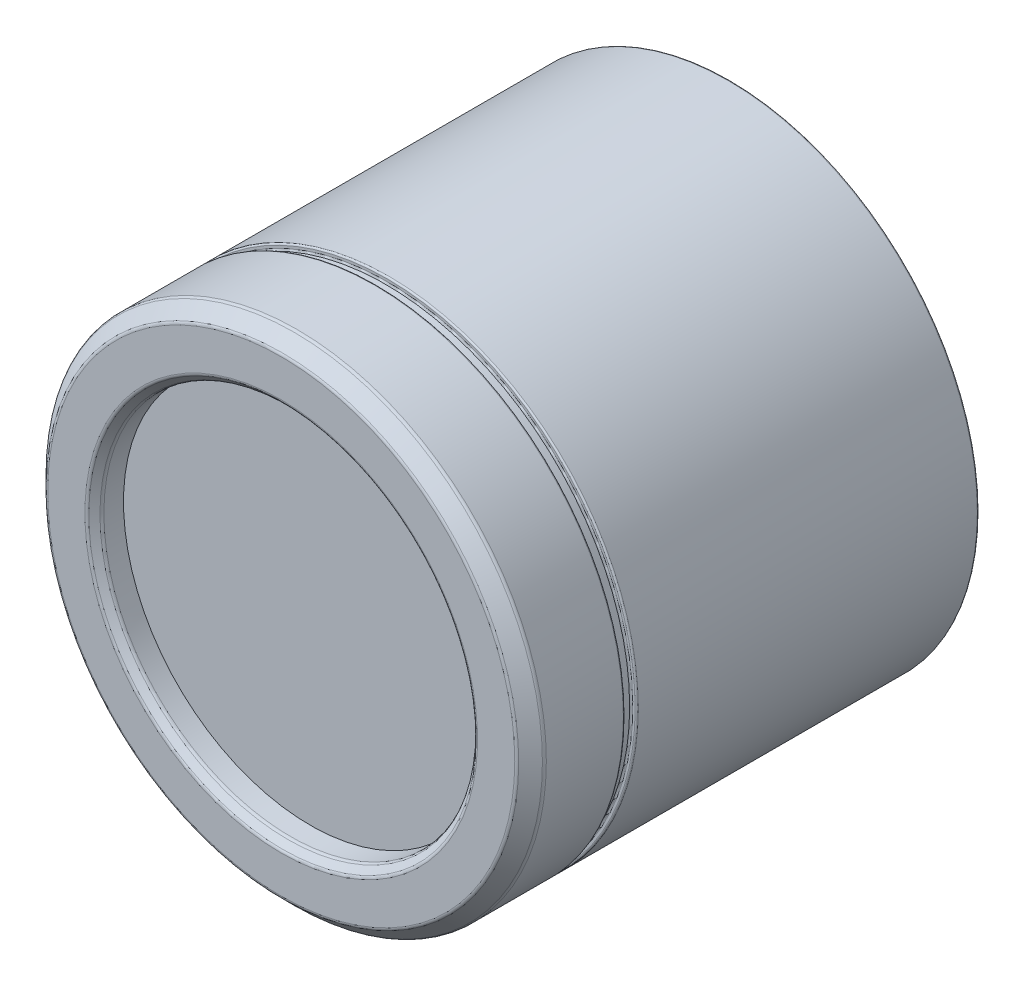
ISO-10303-21;
HEADER;
FILE_DESCRIPTION(('STEP AP214'),'2;1');
FILE_NAME('part.step','',(''),(''),'','','');
FILE_SCHEMA(('AUTOMOTIVE_DESIGN { 1 0 10303 214 1 1 1 1 }'));
ENDSEC;
DATA;
#1=APPLICATION_CONTEXT('core data for automotive mechanical design processes');
#2=APPLICATION_PROTOCOL_DEFINITION('international standard','automotive_design',2000,#1);
#3=PRODUCT_CONTEXT('',#1,'mechanical');
#4=PRODUCT('Part','Part','',(#3));
#5=PRODUCT_RELATED_PRODUCT_CATEGORY('part','',(#4));
#6=PRODUCT_DEFINITION_FORMATION('','',#4);
#7=PRODUCT_DEFINITION_CONTEXT('part definition',#1,'design');
#8=PRODUCT_DEFINITION('design','',#6,#7);
#9=PRODUCT_DEFINITION_SHAPE('','',#8);
#10=(LENGTH_UNIT() NAMED_UNIT(*) SI_UNIT(.MILLI.,.METRE.));
#11=(NAMED_UNIT(*) PLANE_ANGLE_UNIT() SI_UNIT($,.RADIAN.));
#12=(NAMED_UNIT(*) SI_UNIT($,.STERADIAN.) SOLID_ANGLE_UNIT());
#13=UNCERTAINTY_MEASURE_WITH_UNIT(LENGTH_MEASURE(1.E-05),#10,'distance_accuracy_value','');
#14=(GEOMETRIC_REPRESENTATION_CONTEXT(3) GLOBAL_UNCERTAINTY_ASSIGNED_CONTEXT((#13)) GLOBAL_UNIT_ASSIGNED_CONTEXT((#10,
#11,#12)) REPRESENTATION_CONTEXT('',''));
#15=CARTESIAN_POINT('',(0.,0.,0.));
#16=DIRECTION('',(0.,0.,1.));
#17=DIRECTION('',(1.,0.,0.));
#18=AXIS2_PLACEMENT_3D('',#15,#16,#17);
#19=CARTESIAN_POINT('',(0.,0.,53.3));
#20=DIRECTION('',(0.,0.,1.));
#21=DIRECTION('',(1.,0.,0.));
#22=AXIS2_PLACEMENT_3D('',#19,#20,#21);
#23=PLANE('',#22);
#24=CARTESIAN_POINT('',(0.,0.,53.3));
#25=DIRECTION('',(0.,0.,1.));
#26=DIRECTION('',(1.,0.,0.));
#27=AXIS2_PLACEMENT_3D('',#24,#25,#26);
#28=CIRCLE('',#27,23.75);
#29=CARTESIAN_POINT('',(23.75,0.,53.3));
#30=VERTEX_POINT('',#29);
#31=EDGE_CURVE('E21',#30,#30,#28,.T.);
#32=ORIENTED_EDGE('',*,*,#31,.T.);
#33=EDGE_LOOP('',(#32));
#34=FACE_BOUND('',#33,.T.);
#35=ADVANCED_FACE('F17',(#34),#23,.T.);
#36=CARTESIAN_POINT('',(0.,0.,0.));
#37=DIRECTION('',(0.,0.,1.));
#38=DIRECTION('',(1.,0.,0.));
#39=AXIS2_PLACEMENT_3D('',#36,#37,#38);
#40=CYLINDRICAL_SURFACE('',#39,23.75);
#41=ORIENTED_EDGE('',*,*,#31,.F.);
#42=EDGE_LOOP('',(#41));
#43=FACE_BOUND('',#42,.T.);
#44=CARTESIAN_POINT('',(0.,0.,55.7928932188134));
#45=DIRECTION('',(0.,0.,-1.));
#46=DIRECTION('',(-1.,0.,0.));
#47=AXIS2_PLACEMENT_3D('',#44,#45,#46);
#48=CIRCLE('',#47,23.75);
#49=CARTESIAN_POINT('',(-23.75,0.,55.7928932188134));
#50=VERTEX_POINT('',#49);
#51=EDGE_CURVE('E204',#50,#50,#48,.T.);
#52=ORIENTED_EDGE('',*,*,#51,.F.);
#53=EDGE_LOOP('',(#52));
#54=FACE_BOUND('',#53,.T.);
#55=ADVANCED_FACE('F290',(#43,#54),#40,.F.);
#56=CARTESIAN_POINT('',(0.,0.,55.7928932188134));
#57=DIRECTION('',(0.,0.,-1.));
#58=DIRECTION('',(-1.,0.,0.));
#59=AXIS2_PLACEMENT_3D('',#56,#57,#58);
#60=TOROIDAL_SURFACE('',#59,24.25,0.50000000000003);
#61=CARTESIAN_POINT('',(0.,0.,56.1464466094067));
#62=DIRECTION('',(0.,0.,1.));
#63=DIRECTION('',(0.,-1.,0.));
#64=AXIS2_PLACEMENT_3D('',#61,#62,#63);
#65=CIRCLE('',#64,23.8964466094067);
#66=CARTESIAN_POINT('',(0.,-23.8964466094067,56.1464466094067));
#67=VERTEX_POINT('',#66);
#68=EDGE_CURVE('E199',#67,#67,#65,.T.);
#69=ORIENTED_EDGE('',*,*,#68,.T.);
#70=EDGE_LOOP('',(#69));
#71=FACE_BOUND('',#70,.T.);
#72=ORIENTED_EDGE('',*,*,#51,.T.);
#73=EDGE_LOOP('',(#72));
#74=FACE_BOUND('',#73,.T.);
#75=ADVANCED_FACE('F288',(#71,#74),#60,.T.);
#76=CARTESIAN_POINT('',(0.,0.,56.8535533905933));
#77=DIRECTION('',(0.,0.,1.));
#78=DIRECTION('',(1.,0.,0.));
#79=AXIS2_PLACEMENT_3D('',#76,#77,#78);
#80=CONICAL_SURFACE('',#79,24.6035533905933,0.785398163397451);
#81=ORIENTED_EDGE('',*,*,#68,.F.);
#82=EDGE_LOOP('',(#81));
#83=FACE_BOUND('',#82,.T.);
#84=CARTESIAN_POINT('',(0.,0.,56.8535533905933));
#85=DIRECTION('',(0.,0.,-1.));
#86=DIRECTION('',(1.,0.,0.));
#87=AXIS2_PLACEMENT_3D('',#84,#85,#86);
#88=CIRCLE('',#87,24.6035533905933);
#89=CARTESIAN_POINT('',(24.6035533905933,0.,56.8535533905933));
#90=VERTEX_POINT('',#89);
#91=EDGE_CURVE('E195',#90,#90,#88,.T.);
#92=ORIENTED_EDGE('',*,*,#91,.F.);
#93=EDGE_LOOP('',(#92));
#94=FACE_BOUND('',#93,.T.);
#95=ADVANCED_FACE('F285',(#83,#94),#80,.F.);
#96=CARTESIAN_POINT('',(0.,0.,56.5));
#97=DIRECTION('',(0.,0.,1.));
#98=DIRECTION('',(0.,-1.,0.));
#99=AXIS2_PLACEMENT_3D('',#96,#97,#98);
#100=TOROIDAL_SURFACE('',#99,24.9571067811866,0.500000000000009);
#101=ORIENTED_EDGE('',*,*,#91,.T.);
#102=EDGE_LOOP('',(#101));
#103=FACE_BOUND('',#102,.T.);
#104=CARTESIAN_POINT('',(0.,0.,57.));
#105=DIRECTION('',(0.,0.,1.));
#106=DIRECTION('',(0.,-1.,0.));
#107=AXIS2_PLACEMENT_3D('',#104,#105,#106);
#108=CIRCLE('',#107,24.9571067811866);
#109=CARTESIAN_POINT('',(0.,-24.9571067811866,57.));
#110=VERTEX_POINT('',#109);
#111=EDGE_CURVE('E193',#110,#110,#108,.F.);
#112=ORIENTED_EDGE('',*,*,#111,.F.);
#113=EDGE_LOOP('',(#112));
#114=FACE_BOUND('',#113,.T.);
#115=ADVANCED_FACE('F281',(#103,#114),#100,.T.);
#116=CARTESIAN_POINT('',(0.,0.,51.3));
#117=DIRECTION('',(0.,0.,1.));
#118=DIRECTION('',(1.,0.,0.));
#119=AXIS2_PLACEMENT_3D('',#116,#117,#118);
#120=PLANE('',#119);
#121=CARTESIAN_POINT('',(0.,0.,51.3));
#122=DIRECTION('',(0.,0.,-1.));
#123=DIRECTION('',(-1.,0.,0.));
#124=AXIS2_PLACEMENT_3D('',#121,#122,#123);
#125=CIRCLE('',#124,24.75);
#126=CARTESIAN_POINT('',(-24.75,0.,51.3));
#127=VERTEX_POINT('',#126);
#128=EDGE_CURVE('E191',#127,#127,#125,.T.);
#129=ORIENTED_EDGE('',*,*,#128,.T.);
#130=EDGE_LOOP('',(#129));
#131=FACE_BOUND('',#130,.T.);
#132=ADVANCED_FACE('F274',(#131),#120,.F.);
#133=CARTESIAN_POINT('',(0.,0.,57.));
#134=DIRECTION('',(0.,0.,1.));
#135=DIRECTION('',(1.,0.,0.));
#136=AXIS2_PLACEMENT_3D('',#133,#134,#135);
#137=PLANE('',#136);
#138=CARTESIAN_POINT('',(0.,0.,57.));
#139=DIRECTION('',(0.,0.,1.));
#140=DIRECTION('',(1.,0.,0.));
#141=AXIS2_PLACEMENT_3D('',#138,#139,#140);
#142=CIRCLE('',#141,29.6928932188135);
#143=CARTESIAN_POINT('',(29.6928932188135,0.,57.));
#144=VERTEX_POINT('',#143);
#145=EDGE_CURVE('E188',#144,#144,#142,.F.);
#146=ORIENTED_EDGE('',*,*,#145,.F.);
#147=EDGE_LOOP('',(#146));
#148=FACE_BOUND('',#147,.T.);
#149=ORIENTED_EDGE('',*,*,#111,.T.);
#150=EDGE_LOOP('',(#149));
#151=FACE_BOUND('',#150,.T.);
#152=ADVANCED_FACE('F272',(#148,#151),#137,.T.);
#153=CARTESIAN_POINT('',(0.,0.,51.3));
#154=DIRECTION('',(0.,0.,-1.));
#155=DIRECTION('',(-1.,0.,0.));
#156=AXIS2_PLACEMENT_3D('',#153,#154,#155);
#157=CYLINDRICAL_SURFACE('',#156,24.75);
#158=CARTESIAN_POINT('',(0.,0.,50.3));
#159=DIRECTION('',(0.,0.,-1.));
#160=DIRECTION('',(-1.,0.,0.));
#161=AXIS2_PLACEMENT_3D('',#158,#159,#160);
#162=CIRCLE('',#161,24.75);
#163=CARTESIAN_POINT('',(-24.75,0.,50.3));
#164=VERTEX_POINT('',#163);
#165=EDGE_CURVE('E184',#164,#164,#162,.T.);
#166=ORIENTED_EDGE('',*,*,#165,.T.);
#167=EDGE_LOOP('',(#166));
#168=FACE_BOUND('',#167,.T.);
#169=ORIENTED_EDGE('',*,*,#128,.F.);
#170=EDGE_LOOP('',(#169));
#171=FACE_BOUND('',#170,.T.);
#172=ADVANCED_FACE('F87',(#168,#171),#157,.F.);
#173=CARTESIAN_POINT('',(0.,0.,56.4999999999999));
#174=DIRECTION('',(0.,0.,1.));
#175=DIRECTION('',(1.,0.,0.));
#176=AXIS2_PLACEMENT_3D('',#173,#174,#175);
#177=TOROIDAL_SURFACE('',#176,29.6928932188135,0.50000000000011);
#178=CARTESIAN_POINT('',(0.,0.,56.8535533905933));
#179=DIRECTION('',(0.,0.,-1.));
#180=DIRECTION('',(0.,1.,0.));
#181=AXIS2_PLACEMENT_3D('',#178,#179,#180);
#182=CIRCLE('',#181,30.0464466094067);
#183=CARTESIAN_POINT('',(0.,30.0464466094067,56.8535533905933));
#184=VERTEX_POINT('',#183);
#185=EDGE_CURVE('E187',#184,#184,#182,.T.);
#186=ORIENTED_EDGE('',*,*,#185,.F.);
#187=EDGE_LOOP('',(#186));
#188=FACE_BOUND('',#187,.T.);
#189=ORIENTED_EDGE('',*,*,#145,.T.);
#190=EDGE_LOOP('',(#189));
#191=FACE_BOUND('',#190,.T.);
#192=ADVANCED_FACE('F77',(#188,#191),#177,.T.);
#193=CARTESIAN_POINT('',(0.,-25.5,48.3399999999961));
#194=DIRECTION('',(0.,0.,-1.));
#195=DIRECTION('',(0.,1.,0.));
#196=AXIS2_PLACEMENT_3D('',#193,#194,#195);
#197=CONICAL_SURFACE('',#196,1.64999999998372,1.02974425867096);
#198=CARTESIAN_POINT('',(5.6843418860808E-11,-25.5,49.3314200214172));
#199=VERTEX_POINT('',#198);
#200=VERTEX_LOOP('',#199);
#201=FACE_BOUND('',#200,.T.);
#202=CARTESIAN_POINT('',(0.,-25.5,48.34));
#203=DIRECTION('',(0.,0.,-1.));
#204=DIRECTION('',(-1.,0.,0.));
#205=AXIS2_PLACEMENT_3D('',#202,#203,#204);
#206=CIRCLE('',#205,1.65);
#207=CARTESIAN_POINT('',(1.28600554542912,-24.4662254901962,48.3399999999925));
#208=VERTEX_POINT('',#207);
#209=CARTESIAN_POINT('',(-1.28600554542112,-24.4662254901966,48.3399999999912));
#210=VERTEX_POINT('',#209);
#211=EDGE_CURVE('E66',#208,#210,#206,.T.);
#212=ORIENTED_EDGE('',*,*,#211,.T.);
#213=CARTESIAN_POINT('',(-1.28600554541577,-24.4662254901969,48.3399999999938));
#214=CARTESIAN_POINT('',(-1.25183126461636,-24.4680216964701,48.3566779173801));
#215=CARTESIAN_POINT('',(-1.21755952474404,-24.4697513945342,48.3731629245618));
#216=CARTESIAN_POINT('',(-1.14878131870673,-24.4730767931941,48.4056628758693));
#217=CARTESIAN_POINT('',(-1.11427481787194,-24.4746724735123,48.4216777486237));
#218=CARTESIAN_POINT('',(-1.010096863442,-24.479267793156,48.4690023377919));
#219=CARTESIAN_POINT('',(-0.940025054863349,-24.4820620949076,48.4994644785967));
#220=CARTESIAN_POINT('',(-0.796709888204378,-24.4871502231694,48.5577904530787));
#221=CARTESIAN_POINT('',(-0.723431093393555,-24.4894296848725,48.5855696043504));
#222=CARTESIAN_POINT('',(-0.575094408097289,-24.4933614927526,48.6357934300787));
#223=CARTESIAN_POINT('',(-0.500039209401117,-24.4950147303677,48.6582456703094));
#224=CARTESIAN_POINT('',(-0.373359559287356,-24.4972073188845,48.6890734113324));
#225=CARTESIAN_POINT('',(-0.322281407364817,-24.4979342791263,48.6996458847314));
#226=CARTESIAN_POINT('',(-0.219403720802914,-24.4990715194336,48.7164397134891));
#227=CARTESIAN_POINT('',(-0.167604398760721,-24.4994818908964,48.7226623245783));
#228=CARTESIAN_POINT('',(-0.064240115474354,-24.4999696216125,48.730081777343));
#229=CARTESIAN_POINT('',(-0.0126794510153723,-24.5000508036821,48.7313363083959));
#230=CARTESIAN_POINT('',(0.0903183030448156,-24.4998876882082,48.7288404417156));
#231=CARTESIAN_POINT('',(0.14175538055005,-24.4996433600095,48.7250895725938));
#232=CARTESIAN_POINT('',(0.261272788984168,-24.4987021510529,48.710939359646));
#233=CARTESIAN_POINT('',(0.329134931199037,-24.4978807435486,48.6987288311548));
#234=CARTESIAN_POINT('',(0.463391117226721,-24.4957096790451,48.6678977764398));
#235=CARTESIAN_POINT('',(0.529783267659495,-24.4943593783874,48.6492694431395));
#236=CARTESIAN_POINT('',(0.66184002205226,-24.4911490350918,48.6072304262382));
#237=CARTESIAN_POINT('',(0.727487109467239,-24.489283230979,48.5837664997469));
#238=CARTESIAN_POINT('',(0.857481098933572,-24.4850761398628,48.5336413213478));
#239=CARTESIAN_POINT('',(0.921828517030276,-24.4827350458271,48.5069813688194));
#240=CARTESIAN_POINT('',(1.03658575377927,-24.4781144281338,48.4570650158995));
#241=CARTESIAN_POINT('',(1.08717746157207,-24.4759185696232,48.4342137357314));
#242=CARTESIAN_POINT('',(1.18724370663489,-24.4712673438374,48.3876932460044));
#243=CARTESIAN_POINT('',(1.23672437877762,-24.4688153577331,48.3640369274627));
#244=CARTESIAN_POINT('',(1.2860055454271,-24.4662254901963,48.3399999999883));
#245=B_SPLINE_CURVE_WITH_KNOTS('',3,(#213,#214,#215,#216,#217,#218,#219,#220,#221,#222,#223,
#224,#225,#226,#227,#228,#229,#230,#231,#232,#233,#234,#235,#236,#237,#238,#239,#240,#241,#242,
#243,#244),.UNSPECIFIED.,.F.,.F.,(4,2,2,2,2,2,2,2,2,2,2,2,2,2,2,4),(0.,0.11420578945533,
0.228428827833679,0.457739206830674,0.692820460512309,0.927565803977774,1.08391225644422,
1.24021355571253,1.39469446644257,1.54918992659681,1.75562413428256,1.96231035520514,
2.1714071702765,2.38041926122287,2.54707490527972,2.71175694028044),.UNSPECIFIED.);
#246=EDGE_CURVE('E176',#210,#208,#245,.T.);
#247=ORIENTED_EDGE('',*,*,#246,.T.);
#248=EDGE_LOOP('',(#212,#247));
#249=FACE_BOUND('',#248,.T.);
#250=ADVANCED_FACE('F74',(#201,#249),#197,.F.);
#251=CARTESIAN_POINT('',(0.,0.,50.3));
#252=DIRECTION('',(0.,0.,-1.));
#253=DIRECTION('',(-1.,0.,0.));
#254=AXIS2_PLACEMENT_3D('',#251,#252,#253);
#255=PLANE('',#254);
#256=ORIENTED_EDGE('',*,*,#165,.F.);
#257=EDGE_LOOP('',(#256));
#258=FACE_BOUND('',#257,.T.);
#259=CARTESIAN_POINT('',(0.,0.,50.3));
#260=DIRECTION('',(0.,0.,-1.));
#261=DIRECTION('',(-1.,0.,0.));
#262=AXIS2_PLACEMENT_3D('',#259,#260,#261);
#263=CIRCLE('',#262,24.5);
#264=CARTESIAN_POINT('',(-24.5,0.,50.3));
#265=VERTEX_POINT('',#264);
#266=EDGE_CURVE('E245',#265,#265,#263,.T.);
#267=ORIENTED_EDGE('',*,*,#266,.T.);
#268=EDGE_LOOP('',(#267));
#269=FACE_BOUND('',#268,.T.);
#270=ADVANCED_FACE('F76',(#258,#269),#255,.F.);
#271=CARTESIAN_POINT('',(0.,25.5,48.3399999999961));
#272=DIRECTION('',(0.,0.,-1.));
#273=DIRECTION('',(0.,1.,0.));
#274=AXIS2_PLACEMENT_3D('',#271,#272,#273);
#275=CONICAL_SURFACE('',#274,1.64999999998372,1.02974425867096);
#276=CARTESIAN_POINT('',(5.6843418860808E-11,25.5,49.3314200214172));
#277=VERTEX_POINT('',#276);
#278=VERTEX_LOOP('',#277);
#279=FACE_BOUND('',#278,.T.);
#280=CARTESIAN_POINT('',(1.28600554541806,24.4662254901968,48.3399999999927));
#281=CARTESIAN_POINT('',(1.25183126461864,24.46802169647,48.356677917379));
#282=CARTESIAN_POINT('',(1.21755952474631,24.4697513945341,48.3731629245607));
#283=CARTESIAN_POINT('',(1.148781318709,24.473076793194,48.4056628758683));
#284=CARTESIAN_POINT('',(1.11427481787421,24.4746724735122,48.4216777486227));
#285=CARTESIAN_POINT('',(1.01009686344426,24.4792677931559,48.469002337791));
#286=CARTESIAN_POINT('',(0.940025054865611,24.4820620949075,48.4994644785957));
#287=CARTESIAN_POINT('',(0.796709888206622,24.4871502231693,48.5577904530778));
#288=CARTESIAN_POINT('',(0.723431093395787,24.4894296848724,48.5855696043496));
#289=CARTESIAN_POINT('',(0.575094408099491,24.4933614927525,48.635793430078));
#290=CARTESIAN_POINT('',(0.500039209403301,24.4950147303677,48.6582456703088));
#291=CARTESIAN_POINT('',(0.373359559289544,24.4972073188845,48.6890734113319));
#292=CARTESIAN_POINT('',(0.322281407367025,24.4979342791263,48.699645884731));
#293=CARTESIAN_POINT('',(0.219403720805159,24.4990715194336,48.7164397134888));
#294=CARTESIAN_POINT('',(0.167604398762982,24.4994818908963,48.7226623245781));
#295=CARTESIAN_POINT('',(0.0642401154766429,24.4999696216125,48.7300817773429));
#296=CARTESIAN_POINT('',(0.0126794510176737,24.5000508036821,48.7313363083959));
#297=CARTESIAN_POINT('',(-0.0903183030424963,24.4998876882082,48.7288404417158));
#298=CARTESIAN_POINT('',(-0.141755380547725,24.4996433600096,48.725089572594));
#299=CARTESIAN_POINT('',(-0.261272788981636,24.498702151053,48.7109393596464));
#300=CARTESIAN_POINT('',(-0.329134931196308,24.4978807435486,48.6987288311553));
#301=CARTESIAN_POINT('',(-0.463391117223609,24.4957096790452,48.6678977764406));
#302=CARTESIAN_POINT('',(-0.529783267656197,24.4943593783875,48.6492694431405));
#303=CARTESIAN_POINT('',(-0.661840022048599,24.4911490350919,48.6072304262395));
#304=CARTESIAN_POINT('',(-0.727487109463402,24.4892832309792,48.5837664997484));
#305=CARTESIAN_POINT('',(-0.857481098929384,24.485076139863,48.5336413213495));
#306=CARTESIAN_POINT('',(-0.921828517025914,24.4827350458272,48.5069813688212));
#307=CARTESIAN_POINT('',(-1.03658575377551,24.478114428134,48.4570650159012));
#308=CARTESIAN_POINT('',(-1.08717746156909,24.4759185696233,48.4342137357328));
#309=CARTESIAN_POINT('',(-1.18724370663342,24.4712673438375,48.3876932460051));
#310=CARTESIAN_POINT('',(-1.23672437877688,24.4688153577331,48.364036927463));
#311=CARTESIAN_POINT('',(-1.28600554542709,24.4662254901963,48.3399999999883));
#312=B_SPLINE_CURVE_WITH_KNOTS('',3,(#280,#281,#282,#283,#284,#285,#286,#287,#288,#289,#290,
#291,#292,#293,#294,#295,#296,#297,#298,#299,#300,#301,#302,#303,#304,#305,#306,#307,#308,#309,
#310,#311),.UNSPECIFIED.,.F.,.F.,(4,2,2,2,2,2,2,2,2,2,2,2,2,2,2,4),(0.,0.114205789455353,
0.228428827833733,0.457739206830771,0.692820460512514,0.927565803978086,1.08391225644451,
1.2402135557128,1.3946944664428,1.54918992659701,1.75562413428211,1.96231035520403,
2.17140717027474,2.38041926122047,2.54707490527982,2.71175694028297),.UNSPECIFIED.);
#313=CARTESIAN_POINT('',(1.28600554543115,24.4662254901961,48.3399999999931));
#314=VERTEX_POINT('',#313);
#315=CARTESIAN_POINT('',(-1.28600554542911,24.4662254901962,48.3399999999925));
#316=VERTEX_POINT('',#315);
#317=EDGE_CURVE('E168',#314,#316,#312,.T.);
#318=ORIENTED_EDGE('',*,*,#317,.T.);
#319=CARTESIAN_POINT('',(0.,25.5,48.34));
#320=DIRECTION('',(0.,0.,-1.));
#321=DIRECTION('',(-1.,0.,0.));
#322=AXIS2_PLACEMENT_3D('',#319,#320,#321);
#323=CIRCLE('',#322,1.65);
#324=EDGE_CURVE('E56',#316,#314,#323,.T.);
#325=ORIENTED_EDGE('',*,*,#324,.T.);
#326=EDGE_LOOP('',(#318,#325));
#327=FACE_BOUND('',#326,.T.);
#328=ADVANCED_FACE('F84',(#279,#327),#275,.F.);
#329=CARTESIAN_POINT('',(0.,0.,55.3464466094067));
#330=DIRECTION('',(0.,0.,-1.));
#331=DIRECTION('',(-1.,0.,0.));
#332=AXIS2_PLACEMENT_3D('',#329,#330,#331);
#333=CONICAL_SURFACE('',#332,31.5535533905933,0.785398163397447);
#334=CARTESIAN_POINT('',(0.,0.,55.3464466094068));
#335=DIRECTION('',(0.,0.,-1.));
#336=DIRECTION('',(1.,0.,0.));
#337=AXIS2_PLACEMENT_3D('',#334,#335,#336);
#338=CIRCLE('',#337,31.5535533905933);
#339=CARTESIAN_POINT('',(31.5535533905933,0.,55.3464466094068));
#340=VERTEX_POINT('',#339);
#341=EDGE_CURVE('E244',#340,#340,#338,.T.);
#342=ORIENTED_EDGE('',*,*,#341,.F.);
#343=EDGE_LOOP('',(#342));
#344=FACE_BOUND('',#343,.T.);
#345=ORIENTED_EDGE('',*,*,#185,.T.);
#346=EDGE_LOOP('',(#345));
#347=FACE_BOUND('',#346,.T.);
#348=ADVANCED_FACE('F268',(#344,#347),#333,.T.);
#349=CARTESIAN_POINT('',(0.,-25.5,44.3));
#350=DIRECTION('',(0.,0.,-1.));
#351=DIRECTION('',(-1.,0.,0.));
#352=AXIS2_PLACEMENT_3D('',#349,#350,#351);
#353=CYLINDRICAL_SURFACE('',#352,1.65);
#354=ORIENTED_EDGE('',*,*,#211,.F.);
#355=DIRECTION('',(0.,0.,-1.));
#356=VECTOR('',#355,1.);
#357=CARTESIAN_POINT('',(1.28600554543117,-24.4662254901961,50.3));
#358=LINE('',#357,#356);
#359=CARTESIAN_POINT('',(1.28600554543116,-24.4662254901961,44.3));
#360=VERTEX_POINT('',#359);
#361=EDGE_CURVE('E182',#208,#360,#358,.T.);
#362=ORIENTED_EDGE('',*,*,#361,.T.);
#363=CARTESIAN_POINT('',(0.,-25.5,44.3));
#364=DIRECTION('',(0.,0.,-1.));
#365=DIRECTION('',(-1.,0.,0.));
#366=AXIS2_PLACEMENT_3D('',#363,#364,#365);
#367=CIRCLE('',#366,1.65);
#368=CARTESIAN_POINT('',(-1.28600554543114,-24.4662254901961,44.3));
#369=VERTEX_POINT('',#368);
#370=EDGE_CURVE('E242',#369,#360,#367,.F.);
#371=ORIENTED_EDGE('',*,*,#370,.F.);
#372=DIRECTION('',(0.,0.,-1.));
#373=VECTOR('',#372,1.);
#374=CARTESIAN_POINT('',(-1.28600554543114,-24.4662254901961,50.3));
#375=LINE('',#374,#373);
#376=EDGE_CURVE('E183',#369,#210,#375,.F.);
#377=ORIENTED_EDGE('',*,*,#376,.T.);
#378=EDGE_LOOP('',(#354,#362,#371,#377));
#379=FACE_BOUND('',#378,.T.);
#380=ADVANCED_FACE('F163',(#379),#353,.F.);
#381=CARTESIAN_POINT('',(0.,0.,50.3));
#382=DIRECTION('',(0.,0.,-1.));
#383=DIRECTION('',(-1.,0.,0.));
#384=AXIS2_PLACEMENT_3D('',#381,#382,#383);
#385=CYLINDRICAL_SURFACE('',#384,24.5);
#386=ORIENTED_EDGE('',*,*,#266,.F.);
#387=EDGE_LOOP('',(#386));
#388=FACE_BOUND('',#387,.T.);
#389=CARTESIAN_POINT('',(0.,0.,44.3));
#390=DIRECTION('',(0.,0.,-1.));
#391=DIRECTION('',(-1.,0.,0.));
#392=AXIS2_PLACEMENT_3D('',#389,#390,#391);
#393=CIRCLE('',#392,24.5);
#394=CARTESIAN_POINT('',(-1.28600554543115,24.4662254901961,44.3));
#395=VERTEX_POINT('',#394);
#396=EDGE_CURVE('E50',#395,#369,#393,.F.);
#397=ORIENTED_EDGE('',*,*,#396,.F.);
#398=DIRECTION('',(0.,0.,-1.));
#399=VECTOR('',#398,1.);
#400=CARTESIAN_POINT('',(-1.28600554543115,24.4662254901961,50.3));
#401=LINE('',#400,#399);
#402=EDGE_CURVE('E247',#316,#395,#401,.T.);
#403=ORIENTED_EDGE('',*,*,#402,.F.);
#404=ORIENTED_EDGE('',*,*,#317,.F.);
#405=DIRECTION('',(0.,0.,-1.));
#406=VECTOR('',#405,1.);
#407=CARTESIAN_POINT('',(1.28600554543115,24.4662254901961,50.3));
#408=LINE('',#407,#406);
#409=CARTESIAN_POINT('',(1.28600554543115,24.4662254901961,44.3));
#410=VERTEX_POINT('',#409);
#411=EDGE_CURVE('E252',#410,#314,#408,.F.);
#412=ORIENTED_EDGE('',*,*,#411,.F.);
#413=CARTESIAN_POINT('',(0.,0.,44.3));
#414=DIRECTION('',(0.,0.,-1.));
#415=DIRECTION('',(-1.,0.,0.));
#416=AXIS2_PLACEMENT_3D('',#413,#414,#415);
#417=CIRCLE('',#416,24.5);
#418=EDGE_CURVE('E239',#360,#410,#417,.F.);
#419=ORIENTED_EDGE('',*,*,#418,.F.);
#420=ORIENTED_EDGE('',*,*,#361,.F.);
#421=ORIENTED_EDGE('',*,*,#246,.F.);
#422=ORIENTED_EDGE('',*,*,#376,.F.);
#423=EDGE_LOOP('',(#397,#403,#404,#412,#419,#420,#421,#422));
#424=FACE_BOUND('',#423,.T.);
#425=ADVANCED_FACE('F159',(#388,#424),#385,.F.);
#426=CARTESIAN_POINT('',(0.,25.5,44.3));
#427=DIRECTION('',(0.,0.,-1.));
#428=DIRECTION('',(-1.,0.,0.));
#429=AXIS2_PLACEMENT_3D('',#426,#427,#428);
#430=CYLINDRICAL_SURFACE('',#429,1.65);
#431=ORIENTED_EDGE('',*,*,#324,.F.);
#432=ORIENTED_EDGE('',*,*,#402,.T.);
#433=CARTESIAN_POINT('',(0.,25.5,44.3));
#434=DIRECTION('',(0.,0.,-1.));
#435=DIRECTION('',(-1.,0.,0.));
#436=AXIS2_PLACEMENT_3D('',#433,#434,#435);
#437=CIRCLE('',#436,1.65);
#438=EDGE_CURVE('E36',#410,#395,#437,.F.);
#439=ORIENTED_EDGE('',*,*,#438,.F.);
#440=ORIENTED_EDGE('',*,*,#411,.T.);
#441=EDGE_LOOP('',(#431,#432,#439,#440));
#442=FACE_BOUND('',#441,.T.);
#443=ADVANCED_FACE('F156',(#442),#430,.F.);
#444=CARTESIAN_POINT('',(0.,0.,54.9928932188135));
#445=DIRECTION('',(0.,0.,1.));
#446=DIRECTION('',(0.,-1.,0.));
#447=AXIS2_PLACEMENT_3D('',#444,#445,#446);
#448=TOROIDAL_SURFACE('',#447,31.1999999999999,0.500000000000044);
#449=ORIENTED_EDGE('',*,*,#341,.T.);
#450=EDGE_LOOP('',(#449));
#451=FACE_BOUND('',#450,.T.);
#452=CARTESIAN_POINT('',(0.,0.,54.9928932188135));
#453=DIRECTION('',(0.,0.,-1.));
#454=DIRECTION('',(-1.,0.,0.));
#455=AXIS2_PLACEMENT_3D('',#452,#453,#454);
#456=CIRCLE('',#455,31.7);
#457=CARTESIAN_POINT('',(-31.7,0.,54.9928932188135));
#458=VERTEX_POINT('',#457);
#459=EDGE_CURVE('E237',#458,#458,#456,.T.);
#460=ORIENTED_EDGE('',*,*,#459,.F.);
#461=EDGE_LOOP('',(#460));
#462=FACE_BOUND('',#461,.T.);
#463=ADVANCED_FACE('F154',(#451,#462),#448,.T.);
#464=CARTESIAN_POINT('',(0.,0.,44.3));
#465=DIRECTION('',(0.,0.,-1.));
#466=DIRECTION('',(-1.,0.,0.));
#467=AXIS2_PLACEMENT_3D('',#464,#465,#466);
#468=PLANE('',#467);
#469=CARTESIAN_POINT('',(0.,0.,44.3));
#470=DIRECTION('',(0.,0.,1.));
#471=DIRECTION('',(1.,0.,0.));
#472=AXIS2_PLACEMENT_3D('',#469,#470,#471);
#473=CIRCLE('',#472,28.2);
#474=CARTESIAN_POINT('',(28.2,0.,44.3));
#475=VERTEX_POINT('',#474);
#476=EDGE_CURVE('E233',#475,#475,#473,.T.);
#477=ORIENTED_EDGE('',*,*,#476,.F.);
#478=EDGE_LOOP('',(#477));
#479=FACE_BOUND('',#478,.T.);
#480=ORIENTED_EDGE('',*,*,#438,.T.);
#481=ORIENTED_EDGE('',*,*,#396,.T.);
#482=ORIENTED_EDGE('',*,*,#370,.T.);
#483=ORIENTED_EDGE('',*,*,#418,.T.);
#484=EDGE_LOOP('',(#480,#481,#482,#483));
#485=FACE_BOUND('',#484,.T.);
#486=ADVANCED_FACE('F150',(#479,#485),#468,.T.);
#487=CARTESIAN_POINT('',(0.,0.,56.5));
#488=DIRECTION('',(0.,0.,-1.));
#489=DIRECTION('',(-1.,0.,0.));
#490=AXIS2_PLACEMENT_3D('',#487,#488,#489);
#491=CYLINDRICAL_SURFACE('',#490,31.7);
#492=CARTESIAN_POINT('',(0.,0.,45.2));
#493=DIRECTION('',(0.,0.,-1.));
#494=DIRECTION('',(1.,0.,0.));
#495=AXIS2_PLACEMENT_3D('',#492,#493,#494);
#496=CIRCLE('',#495,31.7);
#497=CARTESIAN_POINT('',(31.7,0.,45.2));
#498=VERTEX_POINT('',#497);
#499=EDGE_CURVE('E236',#498,#498,#496,.T.);
#500=ORIENTED_EDGE('',*,*,#499,.F.);
#501=EDGE_LOOP('',(#500));
#502=FACE_BOUND('',#501,.T.);
#503=ORIENTED_EDGE('',*,*,#459,.T.);
#504=EDGE_LOOP('',(#503));
#505=FACE_BOUND('',#504,.T.);
#506=ADVANCED_FACE('F146',(#502,#505),#491,.T.);
#507=CARTESIAN_POINT('',(0.,0.,44.925));
#508=DIRECTION('',(0.,0.,1.));
#509=DIRECTION('',(1.,0.,0.));
#510=AXIS2_PLACEMENT_3D('',#507,#508,#509);
#511=CONICAL_SURFACE('',#510,28.825,0.785398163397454);
#512=ORIENTED_EDGE('',*,*,#476,.T.);
#513=EDGE_LOOP('',(#512));
#514=FACE_BOUND('',#513,.T.);
#515=CARTESIAN_POINT('',(0.,0.,44.925));
#516=DIRECTION('',(0.,0.,-1.));
#517=DIRECTION('',(-1.,0.,0.));
#518=AXIS2_PLACEMENT_3D('',#515,#516,#517);
#519=CIRCLE('',#518,28.825);
#520=CARTESIAN_POINT('',(-28.825,0.,44.925));
#521=VERTEX_POINT('',#520);
#522=EDGE_CURVE('E232',#521,#521,#519,.T.);
#523=ORIENTED_EDGE('',*,*,#522,.T.);
#524=EDGE_LOOP('',(#523));
#525=FACE_BOUND('',#524,.T.);
#526=ADVANCED_FACE('F143',(#514,#525),#511,.T.);
#527=CARTESIAN_POINT('',(0.,0.,45.2));
#528=DIRECTION('',(0.,0.,1.));
#529=DIRECTION('',(1.,0.,0.));
#530=AXIS2_PLACEMENT_3D('',#527,#528,#529);
#531=TOROIDAL_SURFACE('',#530,31.5,0.199999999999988);
#532=ORIENTED_EDGE('',*,*,#499,.T.);
#533=EDGE_LOOP('',(#532));
#534=FACE_BOUND('',#533,.T.);
#535=CARTESIAN_POINT('',(0.,0.,45.));
#536=DIRECTION('',(0.,0.,1.));
#537=DIRECTION('',(1.,0.,0.));
#538=AXIS2_PLACEMENT_3D('',#535,#536,#537);
#539=CIRCLE('',#538,31.5);
#540=CARTESIAN_POINT('',(31.5,0.,45.));
#541=VERTEX_POINT('',#540);
#542=EDGE_CURVE('E229',#541,#541,#539,.T.);
#543=ORIENTED_EDGE('',*,*,#542,.T.);
#544=EDGE_LOOP('',(#543));
#545=FACE_BOUND('',#544,.T.);
#546=ADVANCED_FACE('F141',(#534,#545),#531,.T.);
#547=CARTESIAN_POINT('',(0.,0.,42.3));
#548=DIRECTION('',(0.,0.,-1.));
#549=DIRECTION('',(-1.,0.,0.));
#550=AXIS2_PLACEMENT_3D('',#547,#548,#549);
#551=CONICAL_SURFACE('',#550,29.7,0.321750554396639);
#552=CARTESIAN_POINT('',(0.,0.,42.3));
#553=DIRECTION('',(0.,0.,-1.));
#554=DIRECTION('',(-1.,0.,0.));
#555=AXIS2_PLACEMENT_3D('',#552,#553,#554);
#556=CIRCLE('',#555,29.7);
#557=CARTESIAN_POINT('',(-29.7,0.,42.3));
#558=VERTEX_POINT('',#557);
#559=EDGE_CURVE('E228',#558,#558,#556,.T.);
#560=ORIENTED_EDGE('',*,*,#559,.T.);
#561=EDGE_LOOP('',(#560));
#562=FACE_BOUND('',#561,.T.);
#563=ORIENTED_EDGE('',*,*,#522,.F.);
#564=EDGE_LOOP('',(#563));
#565=FACE_BOUND('',#564,.T.);
#566=ADVANCED_FACE('F137',(#562,#565),#551,.F.);
#567=CARTESIAN_POINT('',(0.,0.,45.));
#568=DIRECTION('',(0.,0.,1.));
#569=DIRECTION('',(1.,0.,0.));
#570=AXIS2_PLACEMENT_3D('',#567,#568,#569);
#571=PLANE('',#570);
#572=CARTESIAN_POINT('',(0.,0.,45.));
#573=DIRECTION('',(0.,0.,1.));
#574=DIRECTION('',(1.,0.,0.));
#575=AXIS2_PLACEMENT_3D('',#572,#573,#574);
#576=CIRCLE('',#575,31.2);
#577=CARTESIAN_POINT('',(31.2,0.,45.));
#578=VERTEX_POINT('',#577);
#579=EDGE_CURVE('E224',#578,#578,#576,.T.);
#580=ORIENTED_EDGE('',*,*,#579,.T.);
#581=EDGE_LOOP('',(#580));
#582=FACE_BOUND('',#581,.T.);
#583=ORIENTED_EDGE('',*,*,#542,.F.);
#584=EDGE_LOOP('',(#583));
#585=FACE_BOUND('',#584,.T.);
#586=ADVANCED_FACE('F133',(#582,#585),#571,.F.);
#587=CARTESIAN_POINT('',(0.,0.,53.3));
#588=DIRECTION('',(0.,0.,-1.));
#589=DIRECTION('',(-1.,0.,0.));
#590=AXIS2_PLACEMENT_3D('',#587,#588,#589);
#591=CYLINDRICAL_SURFACE('',#590,29.7);
#592=CARTESIAN_POINT('',(0.,0.,4.57));
#593=DIRECTION('',(0.,0.,-1.));
#594=DIRECTION('',(0.,1.,0.));
#595=AXIS2_PLACEMENT_3D('',#592,#593,#594);
#596=CIRCLE('',#595,29.7);
#597=CARTESIAN_POINT('',(0.,29.7,4.57));
#598=VERTEX_POINT('',#597);
#599=EDGE_CURVE('E227',#598,#598,#596,.T.);
#600=ORIENTED_EDGE('',*,*,#599,.T.);
#601=EDGE_LOOP('',(#600));
#602=FACE_BOUND('',#601,.T.);
#603=ORIENTED_EDGE('',*,*,#559,.F.);
#604=EDGE_LOOP('',(#603));
#605=FACE_BOUND('',#604,.T.);
#606=ADVANCED_FACE('F130',(#602,#605),#591,.F.);
#607=CARTESIAN_POINT('',(0.,0.,44.8));
#608=DIRECTION('',(0.,0.,1.));
#609=DIRECTION('',(1.,0.,0.));
#610=AXIS2_PLACEMENT_3D('',#607,#608,#609);
#611=TOROIDAL_SURFACE('',#610,31.2,0.200000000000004);
#612=ORIENTED_EDGE('',*,*,#579,.F.);
#613=EDGE_LOOP('',(#612));
#614=FACE_BOUND('',#613,.T.);
#615=CARTESIAN_POINT('',(0.,0.,44.8));
#616=DIRECTION('',(0.,0.,1.));
#617=DIRECTION('',(1.,0.,0.));
#618=AXIS2_PLACEMENT_3D('',#615,#616,#617);
#619=CIRCLE('',#618,31.);
#620=CARTESIAN_POINT('',(31.,0.,44.8));
#621=VERTEX_POINT('',#620);
#622=EDGE_CURVE('E331',#621,#621,#619,.F.);
#623=ORIENTED_EDGE('',*,*,#622,.F.);
#624=EDGE_LOOP('',(#623));
#625=FACE_BOUND('',#624,.T.);
#626=ADVANCED_FACE('F128',(#614,#625),#611,.F.);
#627=CARTESIAN_POINT('',(0.,0.,3.695));
#628=DIRECTION('',(0.,0.,-1.));
#629=DIRECTION('',(-1.,0.,0.));
#630=AXIS2_PLACEMENT_3D('',#627,#628,#629);
#631=CONICAL_SURFACE('',#630,30.575,0.785398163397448);
#632=ORIENTED_EDGE('',*,*,#599,.F.);
#633=EDGE_LOOP('',(#632));
#634=FACE_BOUND('',#633,.T.);
#635=CARTESIAN_POINT('',(0.,0.,3.695));
#636=DIRECTION('',(0.,0.,-1.));
#637=DIRECTION('',(-1.,0.,0.));
#638=AXIS2_PLACEMENT_3D('',#635,#636,#637);
#639=CIRCLE('',#638,30.575);
#640=CARTESIAN_POINT('',(-30.575,0.,3.695));
#641=VERTEX_POINT('',#640);
#642=EDGE_CURVE('E328',#641,#641,#639,.T.);
#643=ORIENTED_EDGE('',*,*,#642,.T.);
#644=EDGE_LOOP('',(#643));
#645=FACE_BOUND('',#644,.T.);
#646=ADVANCED_FACE('F124',(#634,#645),#631,.F.);
#647=CARTESIAN_POINT('',(0.,0.,43.5));
#648=DIRECTION('',(0.,0.,1.));
#649=DIRECTION('',(1.,0.,0.));
#650=AXIS2_PLACEMENT_3D('',#647,#648,#649);
#651=CYLINDRICAL_SURFACE('',#650,31.);
#652=ORIENTED_EDGE('',*,*,#622,.T.);
#653=EDGE_LOOP('',(#652));
#654=FACE_BOUND('',#653,.T.);
#655=CARTESIAN_POINT('',(0.,0.,43.7));
#656=DIRECTION('',(0.,0.,1.));
#657=DIRECTION('',(1.,0.,0.));
#658=AXIS2_PLACEMENT_3D('',#655,#656,#657);
#659=CIRCLE('',#658,31.);
#660=CARTESIAN_POINT('',(31.,0.,43.7));
#661=VERTEX_POINT('',#660);
#662=EDGE_CURVE('E325',#661,#661,#659,.T.);
#663=ORIENTED_EDGE('',*,*,#662,.T.);
#664=EDGE_LOOP('',(#663));
#665=FACE_BOUND('',#664,.T.);
#666=ADVANCED_FACE('F120',(#654,#665),#651,.T.);
#667=CARTESIAN_POINT('',(0.,0.,3.6));
#668=DIRECTION('',(0.,0.,-1.));
#669=DIRECTION('',(-1.,0.,0.));
#670=AXIS2_PLACEMENT_3D('',#667,#668,#669);
#671=CYLINDRICAL_SURFACE('',#670,30.575);
#672=ORIENTED_EDGE('',*,*,#642,.F.);
#673=EDGE_LOOP('',(#672));
#674=FACE_BOUND('',#673,.T.);
#675=CARTESIAN_POINT('',(0.,0.,0.999999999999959));
#676=DIRECTION('',(0.,0.,-1.));
#677=DIRECTION('',(-1.,0.,0.));
#678=AXIS2_PLACEMENT_3D('',#675,#676,#677);
#679=CIRCLE('',#678,30.575);
#680=CARTESIAN_POINT('',(-30.575,0.,0.999999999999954));
#681=VERTEX_POINT('',#680);
#682=EDGE_CURVE('E223',#681,#681,#679,.T.);
#683=ORIENTED_EDGE('',*,*,#682,.T.);
#684=EDGE_LOOP('',(#683));
#685=FACE_BOUND('',#684,.T.);
#686=ADVANCED_FACE('F117',(#674,#685),#671,.F.);
#687=CARTESIAN_POINT('',(0.,0.,43.7));
#688=DIRECTION('',(0.,0.,1.));
#689=DIRECTION('',(0.,-1.,0.));
#690=AXIS2_PLACEMENT_3D('',#687,#688,#689);
#691=TOROIDAL_SURFACE('',#690,31.2,0.199999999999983);
#692=ORIENTED_EDGE('',*,*,#662,.F.);
#693=EDGE_LOOP('',(#692));
#694=FACE_BOUND('',#693,.T.);
#695=CARTESIAN_POINT('',(0.,0.,43.5));
#696=DIRECTION('',(0.,0.,1.));
#697=DIRECTION('',(0.,-1.,0.));
#698=AXIS2_PLACEMENT_3D('',#695,#696,#697);
#699=CIRCLE('',#698,31.2);
#700=CARTESIAN_POINT('',(0.,-31.2,43.5));
#701=VERTEX_POINT('',#700);
#702=EDGE_CURVE('E220',#701,#701,#699,.F.);
#703=ORIENTED_EDGE('',*,*,#702,.F.);
#704=EDGE_LOOP('',(#703));
#705=FACE_BOUND('',#704,.T.);
#706=ADVANCED_FACE('F115',(#694,#705),#691,.F.);
#707=CARTESIAN_POINT('',(0.,0.,0.));
#708=DIRECTION('',(0.,0.,-1.));
#709=DIRECTION('',(0.,1.,0.));
#710=AXIS2_PLACEMENT_3D('',#707,#708,#709);
#711=CONICAL_SURFACE('',#710,30.875,0.291456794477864);
#712=ORIENTED_EDGE('',*,*,#682,.F.);
#713=EDGE_LOOP('',(#712));
#714=FACE_BOUND('',#713,.T.);
#715=CARTESIAN_POINT('',(0.,0.,0.));
#716=DIRECTION('',(0.,0.,-1.));
#717=DIRECTION('',(0.,1.,0.));
#718=AXIS2_PLACEMENT_3D('',#715,#716,#717);
#719=CIRCLE('',#718,30.875);
#720=CARTESIAN_POINT('',(0.,30.875,0.));
#721=VERTEX_POINT('',#720);
#722=EDGE_CURVE('E217',#721,#721,#719,.T.);
#723=ORIENTED_EDGE('',*,*,#722,.T.);
#724=EDGE_LOOP('',(#723));
#725=FACE_BOUND('',#724,.T.);
#726=ADVANCED_FACE('F111',(#714,#725),#711,.F.);
#727=CARTESIAN_POINT('',(0.,0.,43.5));
#728=DIRECTION('',(0.,0.,1.));
#729=DIRECTION('',(1.,0.,0.));
#730=AXIS2_PLACEMENT_3D('',#727,#728,#729);
#731=PLANE('',#730);
#732=ORIENTED_EDGE('',*,*,#702,.T.);
#733=EDGE_LOOP('',(#732));
#734=FACE_BOUND('',#733,.T.);
#735=CARTESIAN_POINT('',(0.,0.,43.5));
#736=DIRECTION('',(0.,0.,1.));
#737=DIRECTION('',(0.,-1.,0.));
#738=AXIS2_PLACEMENT_3D('',#735,#736,#737);
#739=CIRCLE('',#738,31.5);
#740=CARTESIAN_POINT('',(0.,-31.5,43.5));
#741=VERTEX_POINT('',#740);
#742=EDGE_CURVE('E214',#741,#741,#739,.F.);
#743=ORIENTED_EDGE('',*,*,#742,.F.);
#744=EDGE_LOOP('',(#743));
#745=FACE_BOUND('',#744,.T.);
#746=ADVANCED_FACE('F107',(#734,#745),#731,.T.);
#747=CARTESIAN_POINT('',(0.,0.,0.));
#748=DIRECTION('',(0.,0.,1.));
#749=DIRECTION('',(1.,0.,0.));
#750=AXIS2_PLACEMENT_3D('',#747,#748,#749);
#751=PLANE('',#750);
#752=CARTESIAN_POINT('',(0.,0.,0.));
#753=DIRECTION('',(0.,0.,1.));
#754=DIRECTION('',(0.,-1.,0.));
#755=AXIS2_PLACEMENT_3D('',#752,#753,#754);
#756=CIRCLE('',#755,31.5);
#757=CARTESIAN_POINT('',(0.,-31.5,0.));
#758=VERTEX_POINT('',#757);
#759=EDGE_CURVE('E211',#758,#758,#756,.T.);
#760=ORIENTED_EDGE('',*,*,#759,.F.);
#761=EDGE_LOOP('',(#760));
#762=FACE_BOUND('',#761,.T.);
#763=ORIENTED_EDGE('',*,*,#722,.F.);
#764=EDGE_LOOP('',(#763));
#765=FACE_BOUND('',#764,.T.);
#766=ADVANCED_FACE('F104',(#762,#765),#751,.F.);
#767=CARTESIAN_POINT('',(0.,0.,43.3));
#768=DIRECTION('',(0.,0.,1.));
#769=DIRECTION('',(0.,-1.,0.));
#770=AXIS2_PLACEMENT_3D('',#767,#768,#769);
#771=TOROIDAL_SURFACE('',#770,31.5,0.200000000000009);
#772=CARTESIAN_POINT('',(0.,0.,43.3));
#773=DIRECTION('',(0.,0.,-1.));
#774=DIRECTION('',(-1.,0.,0.));
#775=AXIS2_PLACEMENT_3D('',#772,#773,#774);
#776=CIRCLE('',#775,31.7);
#777=CARTESIAN_POINT('',(-31.7,0.,43.3));
#778=VERTEX_POINT('',#777);
#779=EDGE_CURVE('E27',#778,#778,#776,.T.);
#780=ORIENTED_EDGE('',*,*,#779,.F.);
#781=EDGE_LOOP('',(#780));
#782=FACE_BOUND('',#781,.T.);
#783=ORIENTED_EDGE('',*,*,#742,.T.);
#784=EDGE_LOOP('',(#783));
#785=FACE_BOUND('',#784,.T.);
#786=ADVANCED_FACE('F99',(#782,#785),#771,.T.);
#787=CARTESIAN_POINT('',(0.,0.,0.199999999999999));
#788=DIRECTION('',(0.,0.,1.));
#789=DIRECTION('',(0.,-1.,0.));
#790=AXIS2_PLACEMENT_3D('',#787,#788,#789);
#791=TOROIDAL_SURFACE('',#790,31.5,0.199999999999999);
#792=CARTESIAN_POINT('',(0.,0.,0.199999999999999));
#793=DIRECTION('',(0.,0.,-1.));
#794=DIRECTION('',(-1.,0.,0.));
#795=AXIS2_PLACEMENT_3D('',#792,#793,#794);
#796=CIRCLE('',#795,31.7);
#797=CARTESIAN_POINT('',(-31.7,0.,0.199999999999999));
#798=VERTEX_POINT('',#797);
#799=EDGE_CURVE('E10',#798,#798,#796,.F.);
#800=ORIENTED_EDGE('',*,*,#799,.F.);
#801=EDGE_LOOP('',(#800));
#802=FACE_BOUND('',#801,.T.);
#803=ORIENTED_EDGE('',*,*,#759,.T.);
#804=EDGE_LOOP('',(#803));
#805=FACE_BOUND('',#804,.T.);
#806=ADVANCED_FACE('F19',(#802,#805),#791,.T.);
#807=CARTESIAN_POINT('',(0.,0.,56.5));
#808=DIRECTION('',(0.,0.,-1.));
#809=DIRECTION('',(-1.,0.,0.));
#810=AXIS2_PLACEMENT_3D('',#807,#808,#809);
#811=CYLINDRICAL_SURFACE('',#810,31.7);
#812=ORIENTED_EDGE('',*,*,#779,.T.);
#813=EDGE_LOOP('',(#812));
#814=FACE_BOUND('',#813,.T.);
#815=ORIENTED_EDGE('',*,*,#799,.T.);
#816=EDGE_LOOP('',(#815));
#817=FACE_BOUND('',#816,.T.);
#818=ADVANCED_FACE('F92',(#814,#817),#811,.T.);
#819=CLOSED_SHELL('',(#35,#55,#75,#95,#115,#132,#152,#172,#192,#250,#270,#328,#348,#380,#425,
#443,#463,#486,#506,#526,#546,#566,#586,#606,#626,#646,#666,#686,#706,#726,#746,#766,#786,#806,#818));
#820=MANIFOLD_SOLID_BREP('B1',#819);
#821=ADVANCED_BREP_SHAPE_REPRESENTATION('',(#18,#820),#14);
#822=SHAPE_DEFINITION_REPRESENTATION(#9,#821);
ENDSEC;
END-ISO-10303-21;
